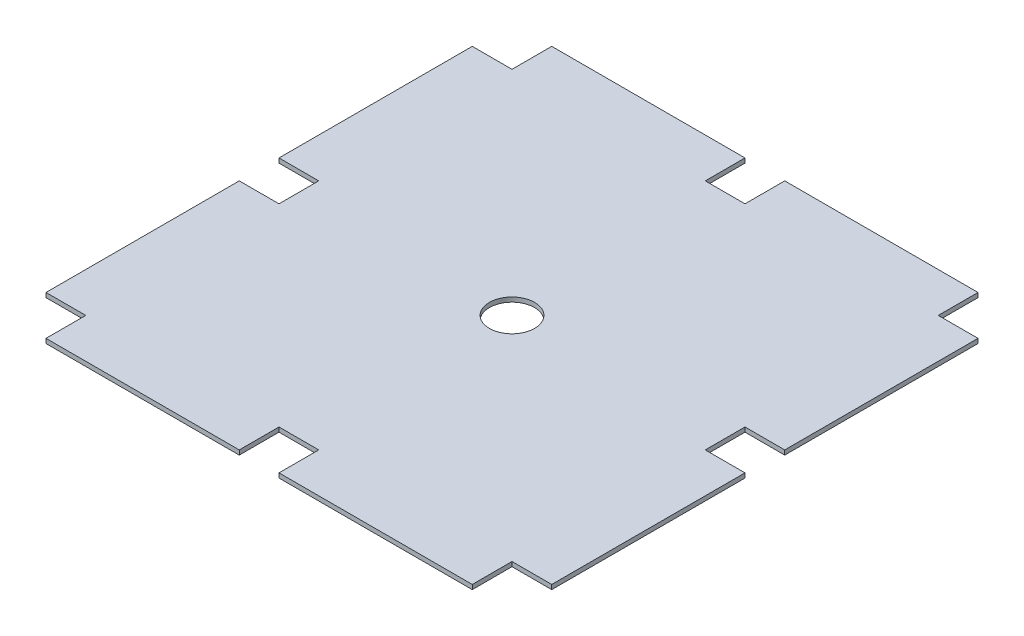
from build123d import *

# Parameters (mm, degrees)
SKETCH1_R           = 15.875
BOSS_EXTRUDE1_DEPTH = 3.175


with BuildPart() as part:
    # Sketch1 → Boss-Extrude1 (new body)
    with BuildSketch(Plane(origin=(0, 0, 0), x_dir=(1, 0, 0), z_dir=(0, 1, 0))):
        Polygon((-149.86, -149.86), (-149.86, -177.8), (-13.97, -177.8), (-13.97, -149.86), (13.97, -149.86), (13.97, -177.8), (149.86, -177.8), (149.86, -149.86), (177.8, -149.86), (177.8, -13.97), (149.86, -13.97), (149.86, 13.97), (177.8, 13.97), (177.8, 149.86), (149.86, 149.86), (149.86, 177.8), (13.97, 177.8), (13.97, 149.86), (-13.97, 149.86), (-13.97, 177.8), (-149.86, 177.8), (-149.86, 149.86), (-177.8, 149.86), (-177.8, 13.97), (-149.86, 13.97), (-149.86, -13.97), (-177.8, -13.97), (-177.8, -149.86), align=None)
        with Locations(Location((0, 0, 0), (0, 0, 270))):
            Circle(SKETCH1_R, mode=Mode.SUBTRACT)
    extrude(amount=BOSS_EXTRUDE1_DEPTH)


solid = part.part
